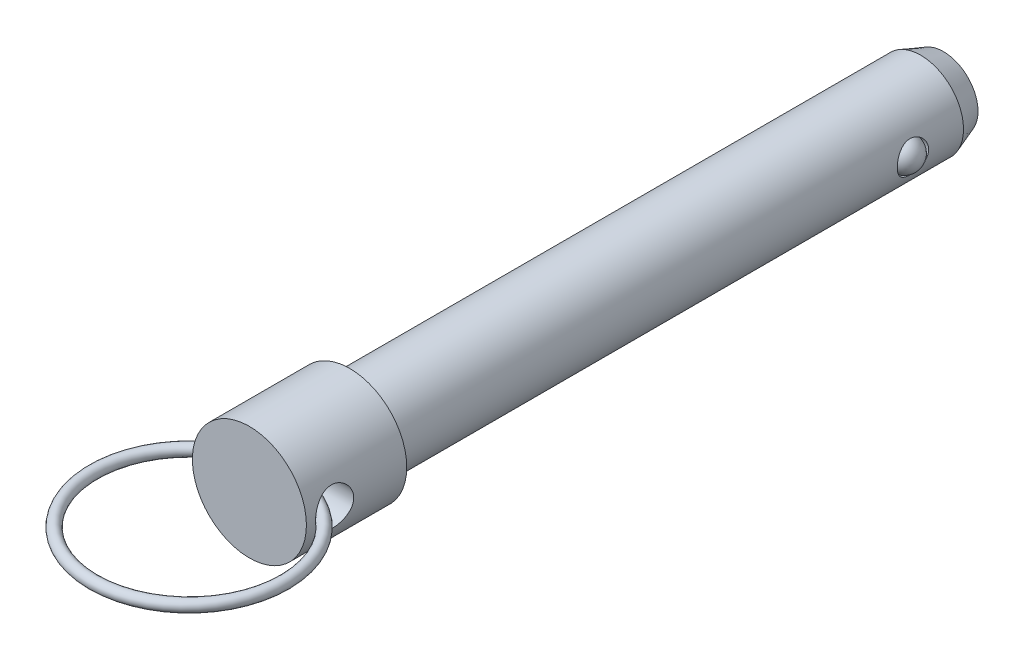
ISO-10303-21;
HEADER;
FILE_DESCRIPTION(('STEP AP214'),'2;1');
FILE_NAME('part.step','',(''),(''),'','','');
FILE_SCHEMA(('AUTOMOTIVE_DESIGN { 1 0 10303 214 1 1 1 1 }'));
ENDSEC;
DATA;
#1=APPLICATION_CONTEXT('core data for automotive mechanical design processes');
#2=APPLICATION_PROTOCOL_DEFINITION('international standard','automotive_design',2000,#1);
#3=PRODUCT_CONTEXT('',#1,'mechanical');
#4=PRODUCT('Part','Part','',(#3));
#5=PRODUCT_RELATED_PRODUCT_CATEGORY('part','',(#4));
#6=PRODUCT_DEFINITION_FORMATION('','',#4);
#7=PRODUCT_DEFINITION_CONTEXT('part definition',#1,'design');
#8=PRODUCT_DEFINITION('design','',#6,#7);
#9=PRODUCT_DEFINITION_SHAPE('','',#8);
#10=(LENGTH_UNIT() NAMED_UNIT(*) SI_UNIT(.MILLI.,.METRE.));
#11=(NAMED_UNIT(*) PLANE_ANGLE_UNIT() SI_UNIT($,.RADIAN.));
#12=(NAMED_UNIT(*) SI_UNIT($,.STERADIAN.) SOLID_ANGLE_UNIT());
#13=UNCERTAINTY_MEASURE_WITH_UNIT(LENGTH_MEASURE(1.E-05),#10,'distance_accuracy_value','');
#14=(GEOMETRIC_REPRESENTATION_CONTEXT(3) GLOBAL_UNCERTAINTY_ASSIGNED_CONTEXT((#13)) GLOBAL_UNIT_ASSIGNED_CONTEXT((#10,
#11,#12)) REPRESENTATION_CONTEXT('',''));
#15=CARTESIAN_POINT('',(0.,0.,0.));
#16=DIRECTION('',(0.,0.,1.));
#17=DIRECTION('',(1.,0.,0.));
#18=AXIS2_PLACEMENT_3D('',#15,#16,#17);
#19=CARTESIAN_POINT('',(12.7,0.,10.033));
#20=DIRECTION('',(-1.,0.,0.));
#21=DIRECTION('',(0.,0.,-1.));
#22=AXIS2_PLACEMENT_3D('',#19,#20,#21);
#23=CYLINDRICAL_SURFACE('',#22,2.6543);
#24=CARTESIAN_POINT('',(-7.93770000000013,0.204387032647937,12.6794191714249));
#25=CARTESIAN_POINT('',(-7.93203532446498,0.186837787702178,12.6807754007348));
#26=CARTESIAN_POINT('',(-7.92708864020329,0.169052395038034,12.681972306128));
#27=CARTESIAN_POINT('',(-7.91867633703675,0.133112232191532,12.6840211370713));
#28=CARTESIAN_POINT('',(-7.91521098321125,0.114957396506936,12.6848730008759));
#29=CARTESIAN_POINT('',(-7.90725600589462,0.0611097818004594,12.6868341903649));
#30=CARTESIAN_POINT('',(-7.90489267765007,0.02505510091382,12.6874261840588));
#31=CARTESIAN_POINT('',(-7.90602604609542,-0.0433721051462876,12.6871434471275));
#32=CARTESIAN_POINT('',(-7.90896866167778,-0.0757576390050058,12.6864073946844));
#33=CARTESIAN_POINT('',(-7.91964228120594,-0.140504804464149,12.6837858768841));
#34=CARTESIAN_POINT('',(-7.92748929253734,-0.172846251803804,12.6818725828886));
#35=CARTESIAN_POINT('',(-7.9377,-0.204387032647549,12.6794191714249));
#36=B_SPLINE_CURVE_WITH_KNOTS('',3,(#24,#25,#26,#27,#28,#29,#30,#31,#32,#33,#34,#35),
.UNSPECIFIED.,.F.,.F.,(4,2,2,2,2,4),(0.,0.0554397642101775,0.110889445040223,0.218734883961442,
0.315961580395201,0.41557992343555),.UNSPECIFIED.);
#37=CARTESIAN_POINT('',(-7.93507776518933,0.196079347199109,12.6800476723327));
#38=VERTEX_POINT('',#37);
#39=CARTESIAN_POINT('',(-7.93507776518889,-0.196079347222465,12.6800476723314));
#40=VERTEX_POINT('',#39);
#41=EDGE_CURVE('E40',#38,#40,#36,.T.);
#42=ORIENTED_EDGE('',*,*,#41,.F.);
#43=CARTESIAN_POINT('',(-7.9375,0.,12.6873));
#44=CARTESIAN_POINT('',(-7.93749419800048,-0.144599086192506,12.687291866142));
#45=CARTESIAN_POINT('',(-7.93350586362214,-0.289346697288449,12.6754287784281));
#46=CARTESIAN_POINT('',(-7.91796098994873,-0.574727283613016,12.628377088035));
#47=CARTESIAN_POINT('',(-7.90639187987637,-0.715353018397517,12.5931497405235));
#48=CARTESIAN_POINT('',(-7.87694898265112,-0.988107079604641,12.5007183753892));
#49=CARTESIAN_POINT('',(-7.85908971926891,-1.12025415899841,12.4435649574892));
#50=CARTESIAN_POINT('',(-7.81889219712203,-1.37303844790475,12.309089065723));
#51=CARTESIAN_POINT('',(-7.79655447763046,-1.49367704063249,12.2317690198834));
#52=CARTESIAN_POINT('',(-7.74887267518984,-1.72429338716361,12.0563063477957));
#53=CARTESIAN_POINT('',(-7.72345600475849,-1.83381503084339,11.9575840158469));
#54=CARTESIAN_POINT('',(-7.67287853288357,-2.03510055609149,11.7433473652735));
#55=CARTESIAN_POINT('',(-7.64771780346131,-2.12685956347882,11.6278284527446));
#56=CARTESIAN_POINT('',(-7.59970655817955,-2.29260675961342,11.3791865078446));
#57=CARTESIAN_POINT('',(-7.57694399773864,-2.36600365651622,11.2456506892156));
#58=CARTESIAN_POINT('',(-7.53740552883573,-2.48910328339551,10.9672472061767));
#59=CARTESIAN_POINT('',(-7.52062775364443,-2.53881340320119,10.8223830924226));
#60=CARTESIAN_POINT('',(-7.49571982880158,-2.61142261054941,10.5306017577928));
#61=CARTESIAN_POINT('',(-7.48731586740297,-2.63517327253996,10.3839205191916));
#62=CARTESIAN_POINT('',(-7.47929744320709,-2.65785147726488,10.0884327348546));
#63=CARTESIAN_POINT('',(-7.47968024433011,-2.65678674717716,9.93962686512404));
#64=CARTESIAN_POINT('',(-7.48895220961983,-2.63052542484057,9.6513899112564));
#65=CARTESIAN_POINT('',(-7.49744899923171,-2.60644192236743,9.51184259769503));
#66=CARTESIAN_POINT('',(-7.52134933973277,-2.53664290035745,9.2388960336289));
#67=CARTESIAN_POINT('',(-7.53675375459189,-2.49092467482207,9.1054975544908));
#68=CARTESIAN_POINT('',(-7.57301259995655,-2.37842702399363,8.84611048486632));
#69=CARTESIAN_POINT('',(-7.59395129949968,-2.31131832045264,8.72027699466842));
#70=CARTESIAN_POINT('',(-7.63888287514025,-2.15817695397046,8.4813127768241));
#71=CARTESIAN_POINT('',(-7.66287647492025,-2.07213980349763,8.36818507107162));
#72=CARTESIAN_POINT('',(-7.71275361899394,-1.87825870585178,8.15160000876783));
#73=CARTESIAN_POINT('',(-7.73867030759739,-1.76950815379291,8.04896027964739));
#74=CARTESIAN_POINT('',(-7.78838348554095,-1.53597600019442,7.86312488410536));
#75=CARTESIAN_POINT('',(-7.8121790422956,-1.41118740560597,7.77993774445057));
#76=CARTESIAN_POINT('',(-7.8552889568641,-1.14734212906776,7.63470081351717));
#77=CARTESIAN_POINT('',(-7.87455248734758,-1.0081467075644,7.57288742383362));
#78=CARTESIAN_POINT('',(-7.90602951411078,-0.720684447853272,7.47391173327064));
#79=CARTESIAN_POINT('',(-7.91825742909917,-0.572436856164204,7.43669899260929));
#80=CARTESIAN_POINT('',(-7.92998601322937,-0.352346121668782,7.40123858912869));
#81=CARTESIAN_POINT('',(-7.93279525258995,-0.282184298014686,7.39279721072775));
#82=CARTESIAN_POINT('',(-7.93655366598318,-0.141360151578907,7.38152592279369));
#83=CARTESIAN_POINT('',(-7.93750283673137,-0.0706978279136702,7.37869602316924));
#84=CARTESIAN_POINT('',(-7.93749419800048,0.144599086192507,7.37870813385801));
#85=CARTESIAN_POINT('',(-7.93350586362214,0.289346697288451,7.39057122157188));
#86=CARTESIAN_POINT('',(-7.91796098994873,0.574727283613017,7.43762291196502));
#87=CARTESIAN_POINT('',(-7.90639187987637,0.715353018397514,7.47285025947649));
#88=CARTESIAN_POINT('',(-7.87694898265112,0.988107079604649,7.56528162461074));
#89=CARTESIAN_POINT('',(-7.85908971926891,1.12025415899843,7.62243504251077));
#90=CARTESIAN_POINT('',(-7.81889219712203,1.37303844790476,7.75691093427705));
#91=CARTESIAN_POINT('',(-7.79655447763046,1.49367704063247,7.83423098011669));
#92=CARTESIAN_POINT('',(-7.74887267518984,1.72429338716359,8.00969365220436));
#93=CARTESIAN_POINT('',(-7.72345600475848,1.83381503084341,8.10841598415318));
#94=CARTESIAN_POINT('',(-7.67287853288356,2.03510055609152,8.32265263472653));
#95=CARTESIAN_POINT('',(-7.64771780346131,2.12685956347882,8.43817154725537));
#96=CARTESIAN_POINT('',(-7.59970655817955,2.29260675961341,8.68681349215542));
#97=CARTESIAN_POINT('',(-7.57694399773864,2.36600365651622,8.82034931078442));
#98=CARTESIAN_POINT('',(-7.53740552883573,2.4891032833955,9.09875279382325));
#99=CARTESIAN_POINT('',(-7.52062775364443,2.53881340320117,9.24361690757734));
#100=CARTESIAN_POINT('',(-7.49571982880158,2.61142261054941,9.53539824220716));
#101=CARTESIAN_POINT('',(-7.48731586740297,2.63517327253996,9.68207948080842));
#102=CARTESIAN_POINT('',(-7.4792974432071,2.65785147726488,9.97756726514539));
#103=CARTESIAN_POINT('',(-7.47968024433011,2.65678674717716,10.126373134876));
#104=CARTESIAN_POINT('',(-7.48895220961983,2.63052542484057,10.4146100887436));
#105=CARTESIAN_POINT('',(-7.49744899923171,2.60644192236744,10.554157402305));
#106=CARTESIAN_POINT('',(-7.52134933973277,2.53664290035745,10.8271039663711));
#107=CARTESIAN_POINT('',(-7.53675375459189,2.49092467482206,10.9605024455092));
#108=CARTESIAN_POINT('',(-7.57301259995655,2.37842702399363,11.2198895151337));
#109=CARTESIAN_POINT('',(-7.59395129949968,2.31131832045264,11.3457230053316));
#110=CARTESIAN_POINT('',(-7.63888287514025,2.15817695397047,11.5846872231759));
#111=CARTESIAN_POINT('',(-7.66287647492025,2.07213980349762,11.6978149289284));
#112=CARTESIAN_POINT('',(-7.71275361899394,1.87825870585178,11.9143999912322));
#113=CARTESIAN_POINT('',(-7.73867030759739,1.76950815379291,12.0170397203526));
#114=CARTESIAN_POINT('',(-7.78838348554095,1.53597600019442,12.2028751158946));
#115=CARTESIAN_POINT('',(-7.8121790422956,1.41118740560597,12.2860622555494));
#116=CARTESIAN_POINT('',(-7.8552889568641,1.14734212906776,12.4312991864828));
#117=CARTESIAN_POINT('',(-7.87455248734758,1.0081467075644,12.4931125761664));
#118=CARTESIAN_POINT('',(-7.90602951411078,0.720684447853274,12.5920882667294));
#119=CARTESIAN_POINT('',(-7.91825742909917,0.572436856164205,12.6293010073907));
#120=CARTESIAN_POINT('',(-7.92998601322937,0.352346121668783,12.6647614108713));
#121=CARTESIAN_POINT('',(-7.93279525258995,0.282184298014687,12.6732027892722));
#122=CARTESIAN_POINT('',(-7.93655366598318,0.141360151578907,12.6844740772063));
#123=CARTESIAN_POINT('',(-7.93750283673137,0.0706978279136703,12.6873039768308));
#124=CARTESIAN_POINT('',(-7.9375,0.,12.6873));
#125=B_SPLINE_CURVE_WITH_KNOTS('',3,(#43,#44,#45,#46,#47,#48,#49,#50,#51,#52,#53,#54,#55,#56,
#57,#58,#59,#60,#61,#62,#63,#64,#65,#66,#67,#68,#69,#70,#71,#72,#73,#74,#75,#76,#77,#78,#79,#80,
#81,#82,#83,#84,#85,#86,#87,#88,#89,#90,#91,#92,#93,#94,#95,#96,#97,#98,#99,#100,#101,#102,#103,
#104,#105,#106,#107,#108,#109,#110,#111,#112,#113,#114,#115,#116,#117,#118,#119,#120,#121,#122,
#123,#124),.UNSPECIFIED.,.T.,.F.,(4,2,2,2,2,2,2,2,2,2,2,2,2,2,2,2,2,2,2,2,2,2,2,2,2,2,2,2,2,2,2,
2,2,2,2,2,2,2,2,2,4),(0.,0.433524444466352,0.867769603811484,1.30101860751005,1.7342154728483,
2.18107203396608,2.62805104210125,3.08796860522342,3.54774258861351,3.99193400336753,
4.43598710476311,4.85959963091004,5.28326515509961,5.71379590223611,6.14442882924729,
6.59763251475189,7.05103448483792,7.50930185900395,7.9666266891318,8.17858641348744,
8.390546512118,8.82407095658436,9.25831611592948,9.69156511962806,10.1247619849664,
10.5716185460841,11.0185975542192,11.4785151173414,11.9382891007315,12.3824805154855,
12.8265336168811,13.250146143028,13.6738116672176,14.1043424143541,14.5349753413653,
14.9881790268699,15.4415809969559,15.8998483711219,16.3571732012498,16.5691329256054,
16.781093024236),.UNSPECIFIED.);
#126=EDGE_CURVE('E66',#40,#38,#125,.T.);
#127=ORIENTED_EDGE('',*,*,#126,.F.);
#128=EDGE_LOOP('',(#42,#127));
#129=FACE_BOUND('',#128,.T.);
#130=CARTESIAN_POINT('',(7.9377,-0.20438703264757,12.6794191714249));
#131=CARTESIAN_POINT('',(7.93203532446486,-0.186837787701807,12.6807754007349));
#132=CARTESIAN_POINT('',(7.92708864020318,-0.169052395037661,12.681972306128));
#133=CARTESIAN_POINT('',(7.91867633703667,-0.133112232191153,12.6840211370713));
#134=CARTESIAN_POINT('',(7.91521098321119,-0.114957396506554,12.6848730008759));
#135=CARTESIAN_POINT('',(7.90725600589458,-0.0611097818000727,12.6868341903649));
#136=CARTESIAN_POINT('',(7.90489267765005,-0.0250551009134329,12.6874261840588));
#137=CARTESIAN_POINT('',(7.90602604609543,0.0433721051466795,12.6871434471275));
#138=CARTESIAN_POINT('',(7.90896866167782,0.0757576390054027,12.6864073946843));
#139=CARTESIAN_POINT('',(7.91964228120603,0.140504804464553,12.683785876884));
#140=CARTESIAN_POINT('',(7.92748929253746,0.172846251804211,12.6818725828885));
#141=CARTESIAN_POINT('',(7.93770000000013,0.204387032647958,12.6794191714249));
#142=B_SPLINE_CURVE_WITH_KNOTS('',3,(#130,#131,#132,#133,#134,#135,#136,#137,#138,#139,#140,
#141),.UNSPECIFIED.,.F.,.F.,(4,2,2,2,2,4),(0.,0.0554397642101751,0.110889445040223,
0.21873488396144,0.31596158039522,0.415579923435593),.UNSPECIFIED.);
#143=CARTESIAN_POINT('',(7.93507776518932,-0.196079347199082,12.6800476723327));
#144=VERTEX_POINT('',#143);
#145=CARTESIAN_POINT('',(7.93507776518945,0.196079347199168,12.6800476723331));
#146=VERTEX_POINT('',#145);
#147=EDGE_CURVE('E33',#144,#146,#142,.T.);
#148=ORIENTED_EDGE('',*,*,#147,.F.);
#149=CARTESIAN_POINT('',(7.9375,0.,7.3787));
#150=CARTESIAN_POINT('',(7.93749419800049,-0.144599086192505,7.37870813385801));
#151=CARTESIAN_POINT('',(7.93350586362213,-0.289346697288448,7.39057122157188));
#152=CARTESIAN_POINT('',(7.91796098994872,-0.574727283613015,7.43762291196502));
#153=CARTESIAN_POINT('',(7.90639187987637,-0.715353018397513,7.47285025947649));
#154=CARTESIAN_POINT('',(7.87694898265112,-0.988107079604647,7.56528162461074));
#155=CARTESIAN_POINT('',(7.8590897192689,-1.12025415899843,7.62243504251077));
#156=CARTESIAN_POINT('',(7.81889219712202,-1.37303844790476,7.75691093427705));
#157=CARTESIAN_POINT('',(7.79655447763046,-1.49367704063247,7.83423098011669));
#158=CARTESIAN_POINT('',(7.74887267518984,-1.72429338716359,8.00969365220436));
#159=CARTESIAN_POINT('',(7.72345600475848,-1.8338150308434,8.10841598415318));
#160=CARTESIAN_POINT('',(7.67287853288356,-2.03510055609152,8.32265263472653));
#161=CARTESIAN_POINT('',(7.64771780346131,-2.12685956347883,8.43817154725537));
#162=CARTESIAN_POINT('',(7.59970655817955,-2.29260675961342,8.68681349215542));
#163=CARTESIAN_POINT('',(7.57694399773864,-2.36600365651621,8.82034931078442));
#164=CARTESIAN_POINT('',(7.53740552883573,-2.4891032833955,9.09875279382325));
#165=CARTESIAN_POINT('',(7.52062775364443,-2.53881340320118,9.24361690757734));
#166=CARTESIAN_POINT('',(7.49571982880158,-2.61142261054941,9.53539824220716));
#167=CARTESIAN_POINT('',(7.48731586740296,-2.63517327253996,9.68207948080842));
#168=CARTESIAN_POINT('',(7.47929744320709,-2.65785147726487,9.97756726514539));
#169=CARTESIAN_POINT('',(7.47968024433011,-2.65678674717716,10.126373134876));
#170=CARTESIAN_POINT('',(7.48895220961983,-2.63052542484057,10.4146100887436));
#171=CARTESIAN_POINT('',(7.49744899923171,-2.60644192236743,10.554157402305));
#172=CARTESIAN_POINT('',(7.52134933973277,-2.53664290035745,10.8271039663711));
#173=CARTESIAN_POINT('',(7.53675375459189,-2.49092467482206,10.9605024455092));
#174=CARTESIAN_POINT('',(7.57301259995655,-2.37842702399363,11.2198895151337));
#175=CARTESIAN_POINT('',(7.59395129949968,-2.31131832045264,11.3457230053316));
#176=CARTESIAN_POINT('',(7.63888287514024,-2.15817695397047,11.5846872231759));
#177=CARTESIAN_POINT('',(7.66287647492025,-2.07213980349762,11.6978149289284));
#178=CARTESIAN_POINT('',(7.71275361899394,-1.87825870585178,11.9143999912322));
#179=CARTESIAN_POINT('',(7.73867030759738,-1.76950815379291,12.0170397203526));
#180=CARTESIAN_POINT('',(7.78838348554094,-1.53597600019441,12.2028751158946));
#181=CARTESIAN_POINT('',(7.8121790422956,-1.41118740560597,12.2860622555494));
#182=CARTESIAN_POINT('',(7.8552889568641,-1.14734212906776,12.4312991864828));
#183=CARTESIAN_POINT('',(7.87455248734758,-1.0081467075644,12.4931125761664));
#184=CARTESIAN_POINT('',(7.90602951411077,-0.72068444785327,12.5920882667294));
#185=CARTESIAN_POINT('',(7.91825742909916,-0.5724368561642,12.6293010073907));
#186=CARTESIAN_POINT('',(7.92998601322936,-0.352346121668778,12.6647614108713));
#187=CARTESIAN_POINT('',(7.93279525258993,-0.282184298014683,12.6732027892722));
#188=CARTESIAN_POINT('',(7.93655366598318,-0.141360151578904,12.6844740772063));
#189=CARTESIAN_POINT('',(7.93750283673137,-0.0706978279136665,12.6873039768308));
#190=CARTESIAN_POINT('',(7.93749419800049,0.14459908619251,12.687291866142));
#191=CARTESIAN_POINT('',(7.93350586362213,0.289346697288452,12.6754287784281));
#192=CARTESIAN_POINT('',(7.91796098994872,0.574727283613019,12.628377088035));
#193=CARTESIAN_POINT('',(7.90639187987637,0.71535301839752,12.5931497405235));
#194=CARTESIAN_POINT('',(7.87694898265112,0.988107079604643,12.5007183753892));
#195=CARTESIAN_POINT('',(7.8590897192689,1.12025415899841,12.4435649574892));
#196=CARTESIAN_POINT('',(7.81889219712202,1.37303844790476,12.309089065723));
#197=CARTESIAN_POINT('',(7.79655447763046,1.49367704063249,12.2317690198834));
#198=CARTESIAN_POINT('',(7.74887267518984,1.72429338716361,12.0563063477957));
#199=CARTESIAN_POINT('',(7.72345600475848,1.83381503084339,11.9575840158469));
#200=CARTESIAN_POINT('',(7.67287853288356,2.03510055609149,11.7433473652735));
#201=CARTESIAN_POINT('',(7.64771780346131,2.12685956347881,11.6278284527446));
#202=CARTESIAN_POINT('',(7.59970655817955,2.29260675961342,11.3791865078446));
#203=CARTESIAN_POINT('',(7.57694399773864,2.36600365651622,11.2456506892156));
#204=CARTESIAN_POINT('',(7.53740552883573,2.48910328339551,10.9672472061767));
#205=CARTESIAN_POINT('',(7.52062775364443,2.53881340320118,10.8223830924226));
#206=CARTESIAN_POINT('',(7.49571982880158,2.61142261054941,10.5306017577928));
#207=CARTESIAN_POINT('',(7.48731586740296,2.63517327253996,10.3839205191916));
#208=CARTESIAN_POINT('',(7.47929744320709,2.65785147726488,10.0884327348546));
#209=CARTESIAN_POINT('',(7.47968024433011,2.65678674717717,9.93962686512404));
#210=CARTESIAN_POINT('',(7.48895220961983,2.63052542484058,9.6513899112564));
#211=CARTESIAN_POINT('',(7.49744899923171,2.60644192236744,9.51184259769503));
#212=CARTESIAN_POINT('',(7.52134933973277,2.53664290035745,9.23889603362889));
#213=CARTESIAN_POINT('',(7.53675375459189,2.49092467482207,9.1054975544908));
#214=CARTESIAN_POINT('',(7.57301259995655,2.37842702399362,8.84611048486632));
#215=CARTESIAN_POINT('',(7.59395129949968,2.31131832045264,8.72027699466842));
#216=CARTESIAN_POINT('',(7.63888287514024,2.15817695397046,8.4813127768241));
#217=CARTESIAN_POINT('',(7.66287647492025,2.07213980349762,8.36818507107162));
#218=CARTESIAN_POINT('',(7.71275361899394,1.87825870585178,8.15160000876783));
#219=CARTESIAN_POINT('',(7.73867030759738,1.76950815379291,8.04896027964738));
#220=CARTESIAN_POINT('',(7.78838348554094,1.53597600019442,7.86312488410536));
#221=CARTESIAN_POINT('',(7.8121790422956,1.41118740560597,7.77993774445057));
#222=CARTESIAN_POINT('',(7.8552889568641,1.14734212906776,7.63470081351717));
#223=CARTESIAN_POINT('',(7.87455248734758,1.0081467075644,7.57288742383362));
#224=CARTESIAN_POINT('',(7.90602951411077,0.720684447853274,7.47391173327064));
#225=CARTESIAN_POINT('',(7.91825742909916,0.572436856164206,7.43669899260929));
#226=CARTESIAN_POINT('',(7.92998601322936,0.352346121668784,7.40123858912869));
#227=CARTESIAN_POINT('',(7.93279525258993,0.282184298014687,7.39279721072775));
#228=CARTESIAN_POINT('',(7.93655366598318,0.141360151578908,7.38152592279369));
#229=CARTESIAN_POINT('',(7.93750283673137,0.0706978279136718,7.37869602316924));
#230=CARTESIAN_POINT('',(7.9375,0.,7.3787));
#231=B_SPLINE_CURVE_WITH_KNOTS('',3,(#149,#150,#151,#152,#153,#154,#155,#156,#157,#158,#159,
#160,#161,#162,#163,#164,#165,#166,#167,#168,#169,#170,#171,#172,#173,#174,#175,#176,#177,#178,
#179,#180,#181,#182,#183,#184,#185,#186,#187,#188,#189,#190,#191,#192,#193,#194,#195,#196,#197,
#198,#199,#200,#201,#202,#203,#204,#205,#206,#207,#208,#209,#210,#211,#212,#213,#214,#215,#216,
#217,#218,#219,#220,#221,#222,#223,#224,#225,#226,#227,#228,#229,#230),.UNSPECIFIED.,.T.,.F.,(4,
2,2,2,2,2,2,2,2,2,2,2,2,2,2,2,2,2,2,2,2,2,2,2,2,2,2,2,2,2,2,2,2,2,2,2,2,2,2,2,4),(0.,
0.433524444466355,0.867769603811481,1.30101860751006,1.73421547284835,2.18107203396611,
2.62805104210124,3.0879686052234,3.54774258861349,3.99193400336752,4.4359871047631,
4.85959963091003,5.28326515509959,5.71379590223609,6.14442882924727,6.59763251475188,
7.0510344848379,7.50930185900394,7.96662668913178,8.17858641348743,8.39054651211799,
8.82407095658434,9.25831611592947,9.69156511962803,10.1247619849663,10.5716185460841,
11.0185975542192,11.4785151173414,11.9382891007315,12.3824805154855,12.8265336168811,
13.250146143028,13.6738116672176,14.1043424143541,14.5349753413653,14.9881790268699,
15.4415809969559,15.8998483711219,16.3571732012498,16.5691329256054,16.781093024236),.UNSPECIFIED.);
#232=EDGE_CURVE('E62',#146,#144,#231,.T.);
#233=ORIENTED_EDGE('',*,*,#232,.F.);
#234=EDGE_LOOP('',(#148,#233));
#235=FACE_BOUND('',#234,.T.);
#236=ADVANCED_FACE('F14',(#129,#235),#23,.F.);
#237=CARTESIAN_POINT('',(0.,0.,-42.672));
#238=DIRECTION('',(0.,0.,-1.));
#239=DIRECTION('',(1.,0.,0.));
#240=AXIS2_PLACEMENT_3D('',#237,#238,#239);
#241=CYLINDRICAL_SURFACE('',#240,7.9375);
#242=ORIENTED_EDGE('',*,*,#232,.T.);
#243=CARTESIAN_POINT('',(7.93699330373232,-0.0896892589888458,10.7221702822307));
#244=CARTESIAN_POINT('',(7.93652822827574,-0.130769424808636,10.7274679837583));
#245=CARTESIAN_POINT('',(7.93574664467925,-0.171433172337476,10.7364092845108));
#246=CARTESIAN_POINT('',(7.93364106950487,-0.250655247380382,10.7611923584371));
#247=CARTESIAN_POINT('',(7.93231567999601,-0.289207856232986,10.7770519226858));
#248=CARTESIAN_POINT('',(7.92928275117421,-0.36295793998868,10.8148927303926));
#249=CARTESIAN_POINT('',(7.92757676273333,-0.398168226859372,10.8368492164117));
#250=CARTESIAN_POINT('',(7.92395955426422,-0.46463035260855,10.8860295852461));
#251=CARTESIAN_POINT('',(7.92204841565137,-0.495883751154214,10.9132513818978));
#252=CARTESIAN_POINT('',(7.91808508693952,-0.555685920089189,10.97377260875));
#253=CARTESIAN_POINT('',(7.91603122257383,-0.583966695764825,11.0073356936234));
#254=CARTESIAN_POINT('',(7.91207775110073,-0.635291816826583,11.0782504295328));
#255=CARTESIAN_POINT('',(7.91017822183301,-0.658333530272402,11.1156039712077));
#256=CARTESIAN_POINT('',(7.90643802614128,-0.701917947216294,11.1984415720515));
#257=CARTESIAN_POINT('',(7.90464142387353,-0.721680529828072,11.2443371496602));
#258=CARTESIAN_POINT('',(7.90157869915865,-0.754473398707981,11.3384773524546));
#259=CARTESIAN_POINT('',(7.90031286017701,-0.767500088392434,11.3867232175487));
#260=CARTESIAN_POINT('',(7.89822583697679,-0.78871450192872,11.492699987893));
#261=CARTESIAN_POINT('',(7.89751439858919,-0.795728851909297,11.5506679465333));
#262=CARTESIAN_POINT('',(7.89694142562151,-0.801390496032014,11.6670214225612));
#263=CARTESIAN_POINT('',(7.89708055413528,-0.800031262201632,11.7254072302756));
#264=CARTESIAN_POINT('',(7.89824238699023,-0.788490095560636,11.8504865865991));
#265=CARTESIAN_POINT('',(7.89939936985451,-0.776966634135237,11.9170573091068));
#266=CARTESIAN_POINT('',(7.90261098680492,-0.743590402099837,12.0475728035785));
#267=CARTESIAN_POINT('',(7.90466591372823,-0.72173426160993,12.1115167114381));
#268=CARTESIAN_POINT('',(7.90910435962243,-0.671214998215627,12.2269281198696));
#269=CARTESIAN_POINT('',(7.91141136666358,-0.643792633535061,12.2789413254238));
#270=CARTESIAN_POINT('',(7.9162723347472,-0.580974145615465,12.3779063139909));
#271=CARTESIAN_POINT('',(7.91882592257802,-0.545589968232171,12.4248655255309));
#272=CARTESIAN_POINT('',(7.92321294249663,-0.476924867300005,12.5002173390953));
#273=CARTESIAN_POINT('',(7.92506174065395,-0.445468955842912,12.5302699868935));
#274=CARTESIAN_POINT('',(7.92855714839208,-0.378177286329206,12.5850250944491));
#275=CARTESIAN_POINT('',(7.93020403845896,-0.342347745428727,12.6097350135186));
#276=CARTESIAN_POINT('',(7.93284282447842,-0.273620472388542,12.648375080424));
#277=CARTESIAN_POINT('',(7.93389934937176,-0.241370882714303,12.6634477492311));
#278=CARTESIAN_POINT('',(7.93564462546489,-0.174801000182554,12.6880445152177));
#279=CARTESIAN_POINT('',(7.93633364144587,-0.140482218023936,12.6975726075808));
#280=CARTESIAN_POINT('',(7.93726439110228,-0.0704929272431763,12.7103916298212));
#281=CARTESIAN_POINT('',(7.93750383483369,-0.0348164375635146,12.7136506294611));
#282=CARTESIAN_POINT('',(7.93749607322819,0.0365249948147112,12.7135447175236));
#283=CARTESIAN_POINT('',(7.93724892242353,0.0721899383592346,12.7101805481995));
#284=CARTESIAN_POINT('',(7.93634013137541,0.139477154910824,12.6976601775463));
#285=CARTESIAN_POINT('',(7.93571355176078,0.171193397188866,12.6889933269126));
#286=CARTESIAN_POINT('',(7.93414262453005,0.232898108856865,12.6668946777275));
#287=CARTESIAN_POINT('',(7.93319815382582,0.262885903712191,12.6534610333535));
#288=CARTESIAN_POINT('',(7.93070953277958,0.330541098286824,12.6172427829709));
#289=CARTESIAN_POINT('',(7.92907073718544,0.367334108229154,12.5928314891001));
#290=CARTESIAN_POINT('',(7.92556681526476,0.436465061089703,12.5383604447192));
#291=CARTESIAN_POINT('',(7.92370123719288,0.468793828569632,12.5082893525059));
#292=CARTESIAN_POINT('',(7.91930040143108,0.538689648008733,12.4333509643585));
#293=CARTESIAN_POINT('',(7.916745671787,0.57451190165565,12.3868610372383));
#294=CARTESIAN_POINT('',(7.91186591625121,0.638204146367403,12.2887606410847));
#295=CARTESIAN_POINT('',(7.90954108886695,0.666067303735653,12.2371458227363));
#296=CARTESIAN_POINT('',(7.90531287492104,0.714519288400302,12.1292928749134));
#297=CARTESIAN_POINT('',(7.9034194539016,0.734941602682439,12.0729799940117));
#298=CARTESIAN_POINT('',(7.90030657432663,0.767678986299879,11.9580314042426));
#299=CARTESIAN_POINT('',(7.89908731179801,0.779991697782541,11.899395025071));
#300=CARTESIAN_POINT('',(7.89731302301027,0.797780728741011,11.7702903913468));
#301=CARTESIAN_POINT('',(7.89691665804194,0.801631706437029,11.6995888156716));
#302=CARTESIAN_POINT('',(7.89737434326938,0.797116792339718,11.5585490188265));
#303=CARTESIAN_POINT('',(7.89822786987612,0.788756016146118,11.488210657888));
#304=CARTESIAN_POINT('',(7.90084404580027,0.762038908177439,11.3643204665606));
#305=CARTESIAN_POINT('',(7.90238770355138,0.746048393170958,11.3102526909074));
#306=CARTESIAN_POINT('',(7.90611632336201,0.705442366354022,11.205488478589));
#307=CARTESIAN_POINT('',(7.90830043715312,0.680838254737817,11.1547876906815));
#308=CARTESIAN_POINT('',(7.91271138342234,0.627302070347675,11.0659203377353));
#309=CARTESIAN_POINT('',(7.91488171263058,0.599588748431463,11.0270181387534));
#310=CARTESIAN_POINT('',(7.91930072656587,0.538080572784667,10.9543274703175));
#311=CARTESIAN_POINT('',(7.92154938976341,0.50428737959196,10.9205376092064));
#312=CARTESIAN_POINT('',(7.9258769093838,0.430969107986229,10.8593220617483));
#313=CARTESIAN_POINT('',(7.92795469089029,0.39141152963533,10.8319349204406));
#314=CARTESIAN_POINT('',(7.93164182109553,0.3077475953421,10.7851847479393));
#315=CARTESIAN_POINT('',(7.93325121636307,0.263641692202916,10.7658209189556));
#316=CARTESIAN_POINT('',(7.93561569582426,0.177621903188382,10.7379200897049));
#317=CARTESIAN_POINT('',(7.93644685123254,0.136024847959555,10.7284058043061));
#318=CARTESIAN_POINT('',(7.93744121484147,0.0518653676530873,10.7170577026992));
#319=CARTESIAN_POINT('',(7.93760632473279,0.0093060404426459,10.7152020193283));
#320=CARTESIAN_POINT('',(7.93735299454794,-0.0519629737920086,10.7180810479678));
#321=CARTESIAN_POINT('',(7.93720636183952,-0.070869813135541,10.7197433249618));
#322=CARTESIAN_POINT('',(7.93699330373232,-0.0896892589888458,10.7221702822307));
#323=B_SPLINE_CURVE_WITH_KNOTS('',3,(#243,#244,#245,#246,#247,#248,#249,#250,#251,#252,#253,
#254,#255,#256,#257,#258,#259,#260,#261,#262,#263,#264,#265,#266,#267,#268,#269,#270,#271,#272,
#273,#274,#275,#276,#277,#278,#279,#280,#281,#282,#283,#284,#285,#286,#287,#288,#289,#290,#291,
#292,#293,#294,#295,#296,#297,#298,#299,#300,#301,#302,#303,#304,#305,#306,#307,#308,#309,#310,
#311,#312,#313,#314,#315,#316,#317,#318,#319,#320,#321,#322),.UNSPECIFIED.,.T.,.F.,(4,2,2,2,2,2,
2,2,2,2,2,2,2,2,2,2,2,2,2,2,2,2,2,2,2,2,2,2,2,2,2,2,2,2,2,2,2,2,2,4),(0.,0.124210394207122,
0.248742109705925,0.372775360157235,0.496759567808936,0.628051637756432,0.759409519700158,
0.908842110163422,1.05835440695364,1.23286722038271,1.40751609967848,1.60937414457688,
1.81129806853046,1.98719085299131,2.16282146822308,2.29300546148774,2.42300650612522,
2.52941287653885,2.63574247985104,2.7426122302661,2.84947000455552,2.94770394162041,
3.04597595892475,3.17780580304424,3.30990269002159,3.48520218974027,3.66065175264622,
3.83981616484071,4.01903264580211,4.23044221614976,4.44176325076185,4.61030957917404,
4.7786336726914,4.92148031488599,5.06428800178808,5.20793445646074,5.35156662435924,
5.47894362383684,5.60595667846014,5.66285934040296),.UNSPECIFIED.);
#324=EDGE_CURVE('E27',#144,#146,#323,.T.);
#325=ORIENTED_EDGE('',*,*,#324,.T.);
#326=EDGE_LOOP('',(#242,#325));
#327=FACE_BOUND('',#326,.T.);
#328=CARTESIAN_POINT('',(0.,0.,13.97));
#329=DIRECTION('',(0.,0.,-1.));
#330=DIRECTION('',(1.,0.,0.));
#331=AXIS2_PLACEMENT_3D('',#328,#329,#330);
#332=CIRCLE('',#331,7.9375);
#333=CARTESIAN_POINT('',(7.93749999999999,0.,13.97));
#334=VERTEX_POINT('',#333);
#335=EDGE_CURVE('E70',#334,#334,#332,.T.);
#336=ORIENTED_EDGE('',*,*,#335,.T.);
#337=EDGE_LOOP('',(#336));
#338=FACE_BOUND('',#337,.T.);
#339=CARTESIAN_POINT('',(0.,0.,0.));
#340=DIRECTION('',(0.,0.,-1.));
#341=DIRECTION('',(1.,0.,0.));
#342=AXIS2_PLACEMENT_3D('',#339,#340,#341);
#343=CIRCLE('',#342,7.9375);
#344=CARTESIAN_POINT('',(7.9375,0.,0.));
#345=VERTEX_POINT('',#344);
#346=EDGE_CURVE('E60',#345,#345,#343,.T.);
#347=ORIENTED_EDGE('',*,*,#346,.F.);
#348=EDGE_LOOP('',(#347));
#349=FACE_BOUND('',#348,.T.);
#350=ORIENTED_EDGE('',*,*,#126,.T.);
#351=CARTESIAN_POINT('',(-7.93699330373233,-0.0896892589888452,10.7221702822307));
#352=CARTESIAN_POINT('',(-7.93743878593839,-0.0502040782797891,10.7170881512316));
#353=CARTESIAN_POINT('',(-7.93759300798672,-0.0102169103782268,10.7153578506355));
#354=CARTESIAN_POINT('',(-7.93729618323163,0.0695313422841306,10.7187230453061));
#355=CARTESIAN_POINT('',(-7.93684363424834,0.109291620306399,10.7238354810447));
#356=CARTESIAN_POINT('',(-7.9353856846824,0.187291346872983,10.7406573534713));
#357=CARTESIAN_POINT('',(-7.93438148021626,0.225533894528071,10.7523525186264));
#358=CARTESIAN_POINT('',(-7.93193240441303,0.299545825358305,10.7818254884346));
#359=CARTESIAN_POINT('',(-7.93048773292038,0.335316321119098,10.7996005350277));
#360=CARTESIAN_POINT('',(-7.92726719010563,0.404436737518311,10.8410428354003));
#361=CARTESIAN_POINT('',(-7.92548405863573,0.437705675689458,10.8648440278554));
#362=CARTESIAN_POINT('',(-7.92178517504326,0.50020841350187,10.9172387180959));
#363=CARTESIAN_POINT('',(-7.91986937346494,0.529440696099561,10.9458340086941));
#364=CARTESIAN_POINT('',(-7.915887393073,0.586103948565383,11.0098741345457));
#365=CARTESIAN_POINT('',(-7.91382457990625,0.613087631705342,11.0457138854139));
#366=CARTESIAN_POINT('',(-7.90992227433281,0.661534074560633,11.1209464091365));
#367=CARTESIAN_POINT('',(-7.908082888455,0.682994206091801,11.1603408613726));
#368=CARTESIAN_POINT('',(-7.90452540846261,0.723082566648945,11.2475242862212));
#369=CARTESIAN_POINT('',(-7.90286277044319,0.740860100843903,11.2957058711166));
#370=CARTESIAN_POINT('',(-7.90013513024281,0.769398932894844,11.3941063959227));
#371=CARTESIAN_POINT('',(-7.89907043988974,0.780156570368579,11.4443263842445));
#372=CARTESIAN_POINT('',(-7.89747012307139,0.796210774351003,11.554348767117));
#373=CARTESIAN_POINT('',(-7.89705467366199,0.800273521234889,11.6143332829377));
#374=CARTESIAN_POINT('',(-7.89711253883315,0.79969743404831,11.734278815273));
#375=CARTESIAN_POINT('',(-7.89758667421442,0.795050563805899,11.7942397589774));
#376=CARTESIAN_POINT('',(-7.89947092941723,0.776127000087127,11.9215738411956));
#377=CARTESIAN_POINT('',(-7.90100736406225,0.760545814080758,11.9887539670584));
#378=CARTESIAN_POINT('',(-7.90492609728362,0.718674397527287,12.1196981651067));
#379=CARTESIAN_POINT('',(-7.90730830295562,0.692385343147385,12.1834626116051));
#380=CARTESIAN_POINT('',(-7.91207290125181,0.635336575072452,12.2932216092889));
#381=CARTESIAN_POINT('',(-7.91436076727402,0.606509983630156,12.3402260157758));
#382=CARTESIAN_POINT('',(-7.91905560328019,0.5417717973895,12.4290764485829));
#383=CARTESIAN_POINT('',(-7.92146237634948,0.505871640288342,12.4709306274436));
#384=CARTESIAN_POINT('',(-7.92553520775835,0.43667233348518,12.5379057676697));
#385=CARTESIAN_POINT('',(-7.9272377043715,0.404910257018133,12.5646091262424));
#386=CARTESIAN_POINT('',(-7.93039270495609,0.337506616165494,12.6126059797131));
#387=CARTESIAN_POINT('',(-7.93184553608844,0.301870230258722,12.6339065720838));
#388=CARTESIAN_POINT('',(-7.93412813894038,0.2334262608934,12.6667329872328));
#389=CARTESIAN_POINT('',(-7.93502109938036,0.201118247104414,12.6792905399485));
#390=CARTESIAN_POINT('',(-7.93642349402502,0.13484532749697,12.698839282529));
#391=CARTESIAN_POINT('',(-7.93693318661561,0.100881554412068,12.7058342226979));
#392=CARTESIAN_POINT('',(-7.93750968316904,0.032116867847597,12.7137372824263));
#393=CARTESIAN_POINT('',(-7.93757492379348,-0.00268656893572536,12.7146239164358));
#394=CARTESIAN_POINT('',(-7.93724990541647,-0.0718898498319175,12.7101777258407));
#395=CARTESIAN_POINT('',(-7.93685959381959,-0.106289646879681,12.7048441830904));
#396=CARTESIAN_POINT('',(-7.9357035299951,-0.171860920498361,12.6888272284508));
#397=CARTESIAN_POINT('',(-7.93495870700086,-0.203106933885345,12.6784414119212));
#398=CARTESIAN_POINT('',(-7.93317724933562,-0.263675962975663,12.6531254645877));
#399=CARTESIAN_POINT('',(-7.93214049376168,-0.292998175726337,12.6381934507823));
#400=CARTESIAN_POINT('',(-7.92940993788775,-0.360428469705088,12.597867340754));
#401=CARTESIAN_POINT('',(-7.9276181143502,-0.397454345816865,12.5706684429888));
#402=CARTESIAN_POINT('',(-7.92384885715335,-0.466617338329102,12.5106364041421));
#403=CARTESIAN_POINT('',(-7.92187102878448,-0.498743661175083,12.4777911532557));
#404=CARTESIAN_POINT('',(-7.91727343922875,-0.567662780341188,12.3965661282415));
#405=CARTESIAN_POINT('',(-7.91465361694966,-0.602587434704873,12.346603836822));
#406=CARTESIAN_POINT('',(-7.90974454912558,-0.663922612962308,12.2417401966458));
#407=CARTESIAN_POINT('',(-7.90745554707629,-0.690326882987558,12.186835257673));
#408=CARTESIAN_POINT('',(-7.90341151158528,-0.735193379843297,12.0726554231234));
#409=CARTESIAN_POINT('',(-7.90166748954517,-0.753494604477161,12.0133171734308));
#410=CARTESIAN_POINT('',(-7.89896245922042,-0.781340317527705,11.8925933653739));
#411=CARTESIAN_POINT('',(-7.89800176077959,-0.79088134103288,11.8312070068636));
#412=CARTESIAN_POINT('',(-7.89691830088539,-0.801641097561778,11.6985240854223));
#413=CARTESIAN_POINT('',(-7.89694027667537,-0.801422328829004,11.6271030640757));
#414=CARTESIAN_POINT('',(-7.89826395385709,-0.788278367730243,11.4854399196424));
#415=CARTESIAN_POINT('',(-7.89956436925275,-0.775365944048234,11.4151966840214));
#416=CARTESIAN_POINT('',(-7.90287421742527,-0.740743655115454,11.2949246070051));
#417=CARTESIAN_POINT('',(-7.90464052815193,-0.721867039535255,11.2440707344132));
#418=CARTESIAN_POINT('',(-7.90869169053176,-0.676041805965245,11.1461339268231));
#419=CARTESIAN_POINT('',(-7.91097624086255,-0.649097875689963,11.0990488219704));
#420=CARTESIAN_POINT('',(-7.91583237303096,-0.586925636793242,11.0101024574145));
#421=CARTESIAN_POINT('',(-7.91840607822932,-0.551633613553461,10.968285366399));
#422=CARTESIAN_POINT('',(-7.9234657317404,-0.473413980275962,10.8924229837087));
#423=CARTESIAN_POINT('',(-7.9259517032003,-0.430488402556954,10.858375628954));
#424=CARTESIAN_POINT('',(-7.93009831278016,-0.344976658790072,10.804366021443));
#425=CARTESIAN_POINT('',(-7.93182618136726,-0.303224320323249,10.7830841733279));
#426=CARTESIAN_POINT('',(-7.93466471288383,-0.216479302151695,10.7489652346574));
#427=CARTESIAN_POINT('',(-7.93577772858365,-0.171499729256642,10.7360959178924));
#428=CARTESIAN_POINT('',(-7.93669343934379,-0.113804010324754,10.7255939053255));
#429=CARTESIAN_POINT('',(-7.93685700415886,-0.101770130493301,10.7237252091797));
#430=CARTESIAN_POINT('',(-7.93699330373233,-0.0896892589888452,10.7221702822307));
#431=B_SPLINE_CURVE_WITH_KNOTS('',3,(#351,#352,#353,#354,#355,#356,#357,#358,#359,#360,#361,
#362,#363,#364,#365,#366,#367,#368,#369,#370,#371,#372,#373,#374,#375,#376,#377,#378,#379,#380,
#381,#382,#383,#384,#385,#386,#387,#388,#389,#390,#391,#392,#393,#394,#395,#396,#397,#398,#399,
#400,#401,#402,#403,#404,#405,#406,#407,#408,#409,#410,#411,#412,#413,#414,#415,#416,#417,#418,
#419,#420,#421,#422,#423,#424,#425,#426,#427,#428,#429,#430),.UNSPECIFIED.,.T.,.F.,(4,2,2,2,2,2,
2,2,2,2,2,2,2,2,2,2,2,2,2,2,2,2,2,2,2,2,2,2,2,2,2,2,2,2,2,2,2,2,2,4),(0.,0.119408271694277,
0.239112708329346,0.358558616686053,0.477950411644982,0.600273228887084,0.722641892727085,
0.856839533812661,0.99110091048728,1.1446646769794,1.2983084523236,1.47797963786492,
1.65781668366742,1.86385758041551,2.06987585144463,2.23486354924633,2.39958662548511,
2.52373987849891,2.64772917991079,2.75131418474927,2.85482929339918,2.95870832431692,
3.06259934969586,3.16100048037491,3.25944242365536,3.39661525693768,3.53408604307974,
3.7161618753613,3.89837104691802,4.08405383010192,4.26981002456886,4.48300506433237,
4.69598586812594,4.85816260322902,5.02024528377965,5.183607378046,5.34692604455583,
5.48682759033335,5.62619001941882,5.66272413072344),.UNSPECIFIED.);
#432=EDGE_CURVE('E9',#38,#40,#431,.T.);
#433=ORIENTED_EDGE('',*,*,#432,.T.);
#434=EDGE_LOOP('',(#350,#433));
#435=FACE_BOUND('',#434,.T.);
#436=ADVANCED_FACE('F64',(#327,#338,#349,#435),#241,.T.);
#437=CARTESIAN_POINT('',(0.,0.,0.));
#438=DIRECTION('',(0.,0.,-1.));
#439=DIRECTION('',(-1.,0.,0.));
#440=AXIS2_PLACEMENT_3D('',#437,#438,#439);
#441=PLANE('',#440);
#442=ORIENTED_EDGE('',*,*,#346,.T.);
#443=EDGE_LOOP('',(#442));
#444=FACE_BOUND('',#443,.T.);
#445=CARTESIAN_POINT('',(0.,0.,2.04836148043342E-11));
#446=DIRECTION('',(0.,0.,-1.));
#447=DIRECTION('',(-1.,0.,0.));
#448=AXIS2_PLACEMENT_3D('',#445,#446,#447);
#449=CIRCLE('',#448,5.95503);
#450=CARTESIAN_POINT('',(-5.95503,0.,2.04822346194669E-11));
#451=VERTEX_POINT('',#450);
#452=EDGE_CURVE('E67',#451,#451,#449,.T.);
#453=ORIENTED_EDGE('',*,*,#452,.F.);
#454=EDGE_LOOP('',(#453));
#455=FACE_BOUND('',#454,.T.);
#456=ADVANCED_FACE('F16',(#444,#455),#441,.T.);
#457=CARTESIAN_POINT('',(0.,-7.6835,13.97));
#458=DIRECTION('',(0.,0.,1.));
#459=DIRECTION('',(-1.,0.,0.));
#460=AXIS2_PLACEMENT_3D('',#457,#458,#459);
#461=PLANE('',#460);
#462=ORIENTED_EDGE('',*,*,#335,.F.);
#463=EDGE_LOOP('',(#462));
#464=FACE_BOUND('',#463,.T.);
#465=ADVANCED_FACE('F183',(#464),#461,.T.);
#466=CARTESIAN_POINT('',(-5.46482201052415E-11,7.24250175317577E-11,499937.328));
#467=DIRECTION('',(0.,0.,-1.));
#468=DIRECTION('',(-1.,0.,0.));
#469=AXIS2_PLACEMENT_3D('',#466,#467,#468);
#470=CYLINDRICAL_SURFACE('',#469,5.95503);
#471=ORIENTED_EDGE('',*,*,#452,.T.);
#472=EDGE_LOOP('',(#471));
#473=FACE_BOUND('',#472,.T.);
#474=CARTESIAN_POINT('',(5.95503,0.,-70.27934));
#475=CARTESIAN_POINT('',(5.95502485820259,0.118304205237,-70.2793468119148));
#476=CARTESIAN_POINT('',(5.95146684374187,0.236721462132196,-70.2889966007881));
#477=CARTESIAN_POINT('',(5.9375976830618,0.470154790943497,-70.3272492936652));
#478=CARTESIAN_POINT('',(5.92727603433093,0.585165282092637,-70.3558816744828));
#479=CARTESIAN_POINT('',(5.90099887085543,0.808191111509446,-70.4309496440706));
#480=CARTESIAN_POINT('',(5.88505770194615,0.916223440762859,-70.4773399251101));
#481=CARTESIAN_POINT('',(5.84913995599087,1.12292700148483,-70.5864269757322));
#482=CARTESIAN_POINT('',(5.8291636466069,1.22159885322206,-70.6491226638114));
#483=CARTESIAN_POINT('',(5.78632671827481,1.41087634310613,-70.791739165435));
#484=CARTESIAN_POINT('',(5.76338670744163,1.50104823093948,-70.8722116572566));
#485=CARTESIAN_POINT('',(5.71760716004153,1.66696518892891,-71.0469291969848));
#486=CARTESIAN_POINT('',(5.69476765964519,1.7427054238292,-71.1411788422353));
#487=CARTESIAN_POINT('',(5.6508668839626,1.88029243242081,-71.3449248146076));
#488=CARTESIAN_POINT('',(5.62989954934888,1.94153904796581,-71.4548486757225));
#489=CARTESIAN_POINT('',(5.59334176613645,2.04448448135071,-71.6843276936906));
#490=CARTESIAN_POINT('',(5.57774926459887,2.08619076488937,-71.803879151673));
#491=CARTESIAN_POINT('',(5.55454967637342,2.14718263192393,-72.0442545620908));
#492=CARTESIAN_POINT('',(5.54665093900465,2.16729033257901,-72.1648408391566));
#493=CARTESIAN_POINT('',(5.5388777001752,2.18708493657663,-72.4079146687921));
#494=CARTESIAN_POINT('',(5.53900006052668,2.18677982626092,-72.53040145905));
#495=CARTESIAN_POINT('',(5.54700284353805,2.16638813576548,-72.7663869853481));
#496=CARTESIAN_POINT('',(5.55444167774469,2.14742749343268,-72.8800007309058));
#497=CARTESIAN_POINT('',(5.57550772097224,2.09211913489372,-73.1023052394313));
#498=CARTESIAN_POINT('',(5.58913584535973,2.05576884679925,-73.2109952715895));
#499=CARTESIAN_POINT('',(5.62132084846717,1.96607030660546,-73.4227167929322));
#500=CARTESIAN_POINT('',(5.63996387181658,1.91242135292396,-73.5256072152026));
#501=CARTESIAN_POINT('',(5.68004672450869,1.78986028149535,-73.7212529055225));
#502=CARTESIAN_POINT('',(5.70148735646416,1.72094377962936,-73.8140052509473));
#503=CARTESIAN_POINT('',(5.74642422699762,1.5646114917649,-73.992987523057));
#504=CARTESIAN_POINT('',(5.7699642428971,1.47629458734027,-74.0784211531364));
#505=CARTESIAN_POINT('',(5.81527285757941,1.28627858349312,-74.2335237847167));
#506=CARTESIAN_POINT('',(5.83704064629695,1.18457341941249,-74.303185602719));
#507=CARTESIAN_POINT('',(5.87675647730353,0.968677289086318,-74.4256005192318));
#508=CARTESIAN_POINT('',(5.8946428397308,0.854323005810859,-74.4780864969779));
#509=CARTESIAN_POINT('',(5.92409921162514,0.617704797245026,-74.5627312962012));
#510=CARTESIAN_POINT('',(5.93568202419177,0.495457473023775,-74.5949313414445));
#511=CARTESIAN_POINT('',(5.94727312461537,0.310034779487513,-74.6269224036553));
#512=CARTESIAN_POINT('',(5.95017232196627,0.248342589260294,-74.6348677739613));
#513=CARTESIAN_POINT('',(5.95405211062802,0.124444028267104,-74.6454783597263));
#514=CARTESIAN_POINT('',(5.95503270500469,0.0622376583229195,-74.6481435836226));
#515=CARTESIAN_POINT('',(5.95502485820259,-0.118304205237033,-74.6481331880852));
#516=CARTESIAN_POINT('',(5.95146684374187,-0.236721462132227,-74.6384833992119));
#517=CARTESIAN_POINT('',(5.9375976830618,-0.470154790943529,-74.6002307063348));
#518=CARTESIAN_POINT('',(5.92727603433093,-0.585165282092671,-74.5715983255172));
#519=CARTESIAN_POINT('',(5.90099887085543,-0.808191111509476,-74.4965303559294));
#520=CARTESIAN_POINT('',(5.88505770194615,-0.916223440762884,-74.4501400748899));
#521=CARTESIAN_POINT('',(5.84913995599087,-1.12292700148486,-74.3410530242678));
#522=CARTESIAN_POINT('',(5.8291636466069,-1.2215988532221,-74.2783573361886));
#523=CARTESIAN_POINT('',(5.78632671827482,-1.41087634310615,-74.135740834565));
#524=CARTESIAN_POINT('',(5.76338670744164,-1.50104823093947,-74.0552683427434));
#525=CARTESIAN_POINT('',(5.71760716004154,-1.66696518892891,-73.8805508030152));
#526=CARTESIAN_POINT('',(5.69476765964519,-1.74270542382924,-73.7863011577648));
#527=CARTESIAN_POINT('',(5.6508668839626,-1.88029243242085,-73.5825551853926));
#528=CARTESIAN_POINT('',(5.6298995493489,-1.94153904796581,-73.4726313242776));
#529=CARTESIAN_POINT('',(5.59334176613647,-2.04448448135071,-73.2431523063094));
#530=CARTESIAN_POINT('',(5.57774926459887,-2.0861907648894,-73.1236008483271));
#531=CARTESIAN_POINT('',(5.55454967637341,-2.14718263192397,-72.8832254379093));
#532=CARTESIAN_POINT('',(5.54665093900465,-2.16729033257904,-72.7626391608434));
#533=CARTESIAN_POINT('',(5.5388777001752,-2.18708493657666,-72.519565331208));
#534=CARTESIAN_POINT('',(5.53900006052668,-2.18677982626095,-72.3970785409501));
#535=CARTESIAN_POINT('',(5.54700284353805,-2.16638813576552,-72.161093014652));
#536=CARTESIAN_POINT('',(5.55444167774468,-2.14742749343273,-72.0474792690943));
#537=CARTESIAN_POINT('',(5.57550772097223,-2.09211913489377,-71.8251747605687));
#538=CARTESIAN_POINT('',(5.58913584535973,-2.05576884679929,-71.7164847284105));
#539=CARTESIAN_POINT('',(5.62132084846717,-1.9660703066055,-71.5047632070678));
#540=CARTESIAN_POINT('',(5.63996387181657,-1.91242135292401,-71.4018727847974));
#541=CARTESIAN_POINT('',(5.68004672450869,-1.7898602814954,-71.2062270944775));
#542=CARTESIAN_POINT('',(5.70148735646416,-1.72094377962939,-71.1134747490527));
#543=CARTESIAN_POINT('',(5.74642422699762,-1.56461149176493,-70.934492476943));
#544=CARTESIAN_POINT('',(5.7699642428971,-1.47629458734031,-70.8490588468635));
#545=CARTESIAN_POINT('',(5.81527285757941,-1.28627858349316,-70.6939562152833));
#546=CARTESIAN_POINT('',(5.83704064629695,-1.18457341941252,-70.624294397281));
#547=CARTESIAN_POINT('',(5.87675647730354,-0.968677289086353,-70.5018794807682));
#548=CARTESIAN_POINT('',(5.8946428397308,-0.854323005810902,-70.449393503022));
#549=CARTESIAN_POINT('',(5.92409921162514,-0.617704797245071,-70.3647487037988));
#550=CARTESIAN_POINT('',(5.93568202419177,-0.495457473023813,-70.3325486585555));
#551=CARTESIAN_POINT('',(5.94727312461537,-0.310034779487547,-70.3005575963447));
#552=CARTESIAN_POINT('',(5.95017232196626,-0.248342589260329,-70.2926122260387));
#553=CARTESIAN_POINT('',(5.95405211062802,-0.124444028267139,-70.2820016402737));
#554=CARTESIAN_POINT('',(5.95503270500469,-0.062237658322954,-70.2793364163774));
#555=CARTESIAN_POINT('',(5.95503,0.,-70.27934));
#556=B_SPLINE_CURVE_WITH_KNOTS('',3,(#474,#475,#476,#477,#478,#479,#480,#481,#482,#483,#484,
#485,#486,#487,#488,#489,#490,#491,#492,#493,#494,#495,#496,#497,#498,#499,#500,#501,#502,#503,
#504,#505,#506,#507,#508,#509,#510,#511,#512,#513,#514,#515,#516,#517,#518,#519,#520,#521,#522,
#523,#524,#525,#526,#527,#528,#529,#530,#531,#532,#533,#534,#535,#536,#537,#538,#539,#540,#541,
#542,#543,#544,#545,#546,#547,#548,#549,#550,#551,#552,#553,#554,#555),.UNSPECIFIED.,.T.,.F.,(4,
2,2,2,2,2,2,2,2,2,2,2,2,2,2,2,2,2,2,2,2,2,2,2,2,2,2,2,2,2,2,2,2,2,2,2,2,2,2,2,4),(0.,
0.354671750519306,0.709895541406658,1.06421898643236,1.41851893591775,1.78593302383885,
2.15346999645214,2.53427313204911,2.91493065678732,3.28052092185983,3.64596815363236,
3.99063279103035,4.33534841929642,4.68641222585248,5.0375769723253,5.41119617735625,
5.78498521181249,6.16433809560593,6.54291757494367,6.72950413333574,6.91609039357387,
7.27076214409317,7.62598593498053,7.98030938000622,8.33460932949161,8.70202341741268,
9.06956039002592,9.45036352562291,9.83102105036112,10.1966113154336,10.5620585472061,
10.9067231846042,11.2514388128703,11.6025026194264,11.9536673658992,12.3272865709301,
12.7010756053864,13.0804284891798,13.4590079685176,13.6455945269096,13.8321807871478),.UNSPECIFIED.);
#557=CARTESIAN_POINT('',(5.95503,0.,-70.27934));
#558=VERTEX_POINT('',#557);
#559=EDGE_CURVE('E135',#558,#558,#556,.T.);
#560=ORIENTED_EDGE('',*,*,#559,.T.);
#561=EDGE_LOOP('',(#560));
#562=FACE_BOUND('',#561,.T.);
#563=CARTESIAN_POINT('',(0.,0.,-79.497));
#564=DIRECTION('',(0.,0.,-1.));
#565=DIRECTION('',(-1.,0.,0.));
#566=AXIS2_PLACEMENT_3D('',#563,#564,#565);
#567=CIRCLE('',#566,5.95503);
#568=CARTESIAN_POINT('',(-5.95502999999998,0.,-79.497));
#569=VERTEX_POINT('',#568);
#570=EDGE_CURVE('E121',#569,#569,#567,.F.);
#571=ORIENTED_EDGE('',*,*,#570,.T.);
#572=EDGE_LOOP('',(#571));
#573=FACE_BOUND('',#572,.T.);
#574=CARTESIAN_POINT('',(-5.95503,0.,-74.64814));
#575=CARTESIAN_POINT('',(-5.9550248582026,0.118304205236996,-74.6481331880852));
#576=CARTESIAN_POINT('',(-5.95146684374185,0.23672146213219,-74.6384833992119));
#577=CARTESIAN_POINT('',(-5.93759768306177,0.470154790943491,-74.6002307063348));
#578=CARTESIAN_POINT('',(-5.92727603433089,0.585165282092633,-74.5715983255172));
#579=CARTESIAN_POINT('',(-5.9009988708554,0.808191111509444,-74.4965303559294));
#580=CARTESIAN_POINT('',(-5.88505770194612,0.916223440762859,-74.4501400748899));
#581=CARTESIAN_POINT('',(-5.84913995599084,1.12292700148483,-74.3410530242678));
#582=CARTESIAN_POINT('',(-5.82916364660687,1.22159885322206,-74.2783573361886));
#583=CARTESIAN_POINT('',(-5.78632671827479,1.41087634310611,-74.135740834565));
#584=CARTESIAN_POINT('',(-5.76338670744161,1.50104823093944,-74.0552683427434));
#585=CARTESIAN_POINT('',(-5.71760716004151,1.66696518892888,-73.8805508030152));
#586=CARTESIAN_POINT('',(-5.69476765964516,1.7427054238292,-73.7863011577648));
#587=CARTESIAN_POINT('',(-5.65086688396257,1.88029243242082,-73.5825551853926));
#588=CARTESIAN_POINT('',(-5.62989954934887,1.94153904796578,-73.4726313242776));
#589=CARTESIAN_POINT('',(-5.59334176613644,2.04448448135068,-73.2431523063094));
#590=CARTESIAN_POINT('',(-5.57774926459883,2.08619076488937,-73.1236008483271));
#591=CARTESIAN_POINT('',(-5.55454967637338,2.14718263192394,-72.8832254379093));
#592=CARTESIAN_POINT('',(-5.54665093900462,2.16729033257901,-72.7626391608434));
#593=CARTESIAN_POINT('',(-5.53887770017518,2.18708493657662,-72.519565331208));
#594=CARTESIAN_POINT('',(-5.53900006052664,2.18677982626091,-72.3970785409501));
#595=CARTESIAN_POINT('',(-5.54700284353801,2.16638813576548,-72.161093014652));
#596=CARTESIAN_POINT('',(-5.55444167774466,2.14742749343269,-72.0474792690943));
#597=CARTESIAN_POINT('',(-5.57550772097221,2.09211913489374,-71.8251747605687));
#598=CARTESIAN_POINT('',(-5.58913584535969,2.05576884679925,-71.7164847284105));
#599=CARTESIAN_POINT('',(-5.62132084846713,1.96607030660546,-71.5047632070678));
#600=CARTESIAN_POINT('',(-5.63996387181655,1.91242135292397,-71.4018727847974));
#601=CARTESIAN_POINT('',(-5.68004672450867,1.78986028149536,-71.2062270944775));
#602=CARTESIAN_POINT('',(-5.70148735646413,1.72094377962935,-71.1134747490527));
#603=CARTESIAN_POINT('',(-5.74642422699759,1.56461149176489,-70.934492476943));
#604=CARTESIAN_POINT('',(-5.76996424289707,1.47629458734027,-70.8490588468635));
#605=CARTESIAN_POINT('',(-5.81527285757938,1.28627858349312,-70.6939562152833));
#606=CARTESIAN_POINT('',(-5.83704064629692,1.18457341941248,-70.624294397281));
#607=CARTESIAN_POINT('',(-5.87675647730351,0.968677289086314,-70.5018794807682));
#608=CARTESIAN_POINT('',(-5.89464283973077,0.854323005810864,-70.4493935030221));
#609=CARTESIAN_POINT('',(-5.92409921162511,0.617704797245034,-70.3647487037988));
#610=CARTESIAN_POINT('',(-5.93568202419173,0.495457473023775,-70.3325486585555));
#611=CARTESIAN_POINT('',(-5.94727312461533,0.310034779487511,-70.3005575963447));
#612=CARTESIAN_POINT('',(-5.95017232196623,0.248342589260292,-70.2926122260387));
#613=CARTESIAN_POINT('',(-5.95405211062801,0.124444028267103,-70.2820016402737));
#614=CARTESIAN_POINT('',(-5.95503270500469,0.0622376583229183,-70.2793364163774));
#615=CARTESIAN_POINT('',(-5.95502485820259,-0.118304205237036,-70.2793468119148));
#616=CARTESIAN_POINT('',(-5.95146684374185,-0.236721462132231,-70.2889966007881));
#617=CARTESIAN_POINT('',(-5.93759768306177,-0.470154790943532,-70.3272492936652));
#618=CARTESIAN_POINT('',(-5.92727603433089,-0.585165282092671,-70.3558816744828));
#619=CARTESIAN_POINT('',(-5.9009988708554,-0.808191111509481,-70.4309496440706));
#620=CARTESIAN_POINT('',(-5.88505770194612,-0.916223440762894,-70.4773399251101));
#621=CARTESIAN_POINT('',(-5.84913995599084,-1.12292700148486,-70.5864269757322));
#622=CARTESIAN_POINT('',(-5.82916364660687,-1.22159885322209,-70.6491226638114));
#623=CARTESIAN_POINT('',(-5.78632671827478,-1.41087634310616,-70.791739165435));
#624=CARTESIAN_POINT('',(-5.7633867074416,-1.50104823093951,-70.8722116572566));
#625=CARTESIAN_POINT('',(-5.71760716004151,-1.66696518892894,-71.0469291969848));
#626=CARTESIAN_POINT('',(-5.69476765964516,-1.74270542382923,-71.1411788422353));
#627=CARTESIAN_POINT('',(-5.65086688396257,-1.88029243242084,-71.3449248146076));
#628=CARTESIAN_POINT('',(-5.62989954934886,-1.94153904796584,-71.4548486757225));
#629=CARTESIAN_POINT('',(-5.59334176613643,-2.04448448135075,-71.6843276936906));
#630=CARTESIAN_POINT('',(-5.57774926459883,-2.08619076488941,-71.803879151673));
#631=CARTESIAN_POINT('',(-5.55454967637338,-2.14718263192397,-72.0442545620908));
#632=CARTESIAN_POINT('',(-5.54665093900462,-2.16729033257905,-72.1648408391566));
#633=CARTESIAN_POINT('',(-5.53887770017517,-2.18708493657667,-72.4079146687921));
#634=CARTESIAN_POINT('',(-5.53900006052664,-2.18677982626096,-72.53040145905));
#635=CARTESIAN_POINT('',(-5.54700284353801,-2.16638813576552,-72.7663869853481));
#636=CARTESIAN_POINT('',(-5.55444167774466,-2.14742749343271,-72.8800007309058));
#637=CARTESIAN_POINT('',(-5.57550772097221,-2.09211913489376,-73.1023052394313));
#638=CARTESIAN_POINT('',(-5.58913584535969,-2.05576884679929,-73.2109952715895));
#639=CARTESIAN_POINT('',(-5.62132084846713,-1.9660703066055,-73.4227167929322));
#640=CARTESIAN_POINT('',(-5.63996387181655,-1.912421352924,-73.5256072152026));
#641=CARTESIAN_POINT('',(-5.68004672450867,-1.78986028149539,-73.7212529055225));
#642=CARTESIAN_POINT('',(-5.70148735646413,-1.72094377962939,-73.8140052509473));
#643=CARTESIAN_POINT('',(-5.74642422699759,-1.56461149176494,-73.992987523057));
#644=CARTESIAN_POINT('',(-5.76996424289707,-1.47629458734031,-74.0784211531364));
#645=CARTESIAN_POINT('',(-5.81527285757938,-1.28627858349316,-74.2335237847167));
#646=CARTESIAN_POINT('',(-5.83704064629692,-1.18457341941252,-74.303185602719));
#647=CARTESIAN_POINT('',(-5.87675647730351,-0.968677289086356,-74.4256005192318));
#648=CARTESIAN_POINT('',(-5.89464283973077,-0.854323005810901,-74.478086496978));
#649=CARTESIAN_POINT('',(-5.92409921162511,-0.617704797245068,-74.5627312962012));
#650=CARTESIAN_POINT('',(-5.93568202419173,-0.495457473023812,-74.5949313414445));
#651=CARTESIAN_POINT('',(-5.94727312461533,-0.310034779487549,-74.6269224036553));
#652=CARTESIAN_POINT('',(-5.95017232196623,-0.248342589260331,-74.6348677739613));
#653=CARTESIAN_POINT('',(-5.95405211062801,-0.124444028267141,-74.6454783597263));
#654=CARTESIAN_POINT('',(-5.95503270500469,-0.0622376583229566,-74.6481435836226));
#655=CARTESIAN_POINT('',(-5.95503,0.,-74.64814));
#656=B_SPLINE_CURVE_WITH_KNOTS('',3,(#574,#575,#576,#577,#578,#579,#580,#581,#582,#583,#584,
#585,#586,#587,#588,#589,#590,#591,#592,#593,#594,#595,#596,#597,#598,#599,#600,#601,#602,#603,
#604,#605,#606,#607,#608,#609,#610,#611,#612,#613,#614,#615,#616,#617,#618,#619,#620,#621,#622,
#623,#624,#625,#626,#627,#628,#629,#630,#631,#632,#633,#634,#635,#636,#637,#638,#639,#640,#641,
#642,#643,#644,#645,#646,#647,#648,#649,#650,#651,#652,#653,#654,#655),.UNSPECIFIED.,.T.,.F.,(4,
2,2,2,2,2,2,2,2,2,2,2,2,2,2,2,2,2,2,2,2,2,2,2,2,2,2,2,2,2,2,2,2,2,2,2,2,2,2,2,4),(0.,
0.354671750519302,0.709895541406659,1.06421898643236,1.41851893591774,1.78593302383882,
2.15346999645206,2.53427313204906,2.91493065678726,3.28052092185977,3.64596815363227,
3.99063279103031,4.33534841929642,4.6864122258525,5.03757697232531,5.41119617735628,
5.7849852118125,6.16433809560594,6.54291757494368,6.72950413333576,6.91609039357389,
7.27076214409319,7.62598593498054,7.98030938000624,8.33460932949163,8.70202341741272,
9.06956039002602,9.45036352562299,9.8310210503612,10.1966113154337,10.5620585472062,
10.9067231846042,11.2514388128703,11.6025026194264,11.9536673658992,12.3272865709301,
12.7010756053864,13.0804284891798,13.4590079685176,13.6455945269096,13.8321807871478),.UNSPECIFIED.);
#657=CARTESIAN_POINT('',(-5.95503,0.,-74.64814));
#658=VERTEX_POINT('',#657);
#659=EDGE_CURVE('E73',#658,#658,#656,.T.);
#660=ORIENTED_EDGE('',*,*,#659,.T.);
#661=EDGE_LOOP('',(#660));
#662=FACE_BOUND('',#661,.T.);
#663=ADVANCED_FACE('F88',(#473,#562,#573,#662),#470,.T.);
#664=CARTESIAN_POINT('',(-4.7371,0.,-72.46374));
#665=DIRECTION('',(0.,0.,-1.));
#666=DIRECTION('',(1.,0.,0.));
#667=AXIS2_PLACEMENT_3D('',#664,#665,#666);
#668=SPHERICAL_SURFACE('',#667,2.1844);
#669=CARTESIAN_POINT('',(-4.7371,0.,-72.46374));
#670=DIRECTION('',(1.,0.,0.));
#671=DIRECTION('',(0.,0.,-1.));
#672=AXIS2_PLACEMENT_3D('',#669,#670,#671);
#673=CIRCLE('',#672,2.1844);
#674=CARTESIAN_POINT('',(-4.7371,0.,-74.64814));
#675=VERTEX_POINT('',#674);
#676=CARTESIAN_POINT('',(-4.7371,0.,-70.27934));
#677=VERTEX_POINT('',#676);
#678=EDGE_CURVE('E116',#675,#677,#673,.F.);
#679=ORIENTED_EDGE('',*,*,#678,.T.);
#680=CARTESIAN_POINT('',(-4.7371,0.,-72.46374));
#681=DIRECTION('',(1.,0.,0.));
#682=DIRECTION('',(0.,0.,-1.));
#683=AXIS2_PLACEMENT_3D('',#680,#681,#682);
#684=CIRCLE('',#683,2.1844);
#685=EDGE_CURVE('E142',#677,#675,#684,.F.);
#686=ORIENTED_EDGE('',*,*,#685,.T.);
#687=EDGE_LOOP('',(#679,#686));
#688=FACE_BOUND('',#687,.T.);
#689=ADVANCED_FACE('F100',(#688),#668,.T.);
#690=CARTESIAN_POINT('',(0.,0.,-82.672));
#691=DIRECTION('',(0.,0.,-1.));
#692=DIRECTION('',(-1.,0.,0.));
#693=AXIS2_PLACEMENT_3D('',#690,#691,#692);
#694=PLANE('',#693);
#695=CARTESIAN_POINT('',(0.,0.,-82.6719999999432));
#696=DIRECTION('',(0.,0.,1.));
#697=DIRECTION('',(1.,0.,0.));
#698=AXIS2_PLACEMENT_3D('',#695,#696,#697);
#699=CIRCLE('',#698,4.79942450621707);
#700=CARTESIAN_POINT('',(4.79942450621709,0.,-82.6719999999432));
#701=VERTEX_POINT('',#700);
#702=EDGE_CURVE('E147',#701,#701,#699,.T.);
#703=ORIENTED_EDGE('',*,*,#702,.F.);
#704=EDGE_LOOP('',(#703));
#705=FACE_BOUND('',#704,.T.);
#706=ADVANCED_FACE('F126',(#705),#694,.T.);
#707=CARTESIAN_POINT('',(4.7371,0.,-72.46374));
#708=DIRECTION('',(0.,0.,1.));
#709=DIRECTION('',(1.,0.,0.));
#710=AXIS2_PLACEMENT_3D('',#707,#708,#709);
#711=SPHERICAL_SURFACE('',#710,2.1844);
#712=CARTESIAN_POINT('',(4.7371,0.,-72.46374));
#713=DIRECTION('',(1.,0.,0.));
#714=DIRECTION('',(0.,0.,-1.));
#715=AXIS2_PLACEMENT_3D('',#712,#713,#714);
#716=CIRCLE('',#715,2.1844);
#717=CARTESIAN_POINT('',(4.7371,0.,-74.64814));
#718=VERTEX_POINT('',#717);
#719=CARTESIAN_POINT('',(4.7371,0.,-70.27934));
#720=VERTEX_POINT('',#719);
#721=EDGE_CURVE('E256',#718,#720,#716,.T.);
#722=ORIENTED_EDGE('',*,*,#721,.T.);
#723=CARTESIAN_POINT('',(4.7371,0.,-72.46374));
#724=DIRECTION('',(1.,0.,0.));
#725=DIRECTION('',(0.,0.,-1.));
#726=AXIS2_PLACEMENT_3D('',#723,#724,#725);
#727=CIRCLE('',#726,2.1844);
#728=EDGE_CURVE('E258',#720,#718,#727,.T.);
#729=ORIENTED_EDGE('',*,*,#728,.T.);
#730=EDGE_LOOP('',(#722,#729));
#731=FACE_BOUND('',#730,.T.);
#732=ADVANCED_FACE('F101',(#731),#711,.T.);
#733=CARTESIAN_POINT('',(-6.35,0.,-72.46374));
#734=DIRECTION('',(1.,0.,0.));
#735=DIRECTION('',(0.,0.,-1.));
#736=AXIS2_PLACEMENT_3D('',#733,#734,#735);
#737=CYLINDRICAL_SURFACE('',#736,2.1844);
#738=ORIENTED_EDGE('',*,*,#659,.F.);
#739=EDGE_LOOP('',(#738));
#740=FACE_BOUND('',#739,.T.);
#741=ORIENTED_EDGE('',*,*,#678,.F.);
#742=ORIENTED_EDGE('',*,*,#685,.F.);
#743=EDGE_LOOP('',(#741,#742));
#744=FACE_BOUND('',#743,.T.);
#745=ADVANCED_FACE('F149',(#740,#744),#737,.F.);
#746=CARTESIAN_POINT('',(0.,0.,-79.4970000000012));
#747=DIRECTION('',(0.,0.,1.));
#748=DIRECTION('',(1.,0.,0.));
#749=AXIS2_PLACEMENT_3D('',#746,#747,#748);
#750=CONICAL_SURFACE('',#749,5.95502999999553,0.349065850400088);
#751=ORIENTED_EDGE('',*,*,#570,.F.);
#752=EDGE_LOOP('',(#751));
#753=FACE_BOUND('',#752,.T.);
#754=ORIENTED_EDGE('',*,*,#702,.T.);
#755=EDGE_LOOP('',(#754));
#756=FACE_BOUND('',#755,.T.);
#757=ADVANCED_FACE('F131',(#753,#756),#750,.T.);
#758=CARTESIAN_POINT('',(-6.35,0.,-72.46374));
#759=DIRECTION('',(1.,0.,0.));
#760=DIRECTION('',(0.,0.,-1.));
#761=AXIS2_PLACEMENT_3D('',#758,#759,#760);
#762=CYLINDRICAL_SURFACE('',#761,2.1844);
#763=ORIENTED_EDGE('',*,*,#721,.F.);
#764=ORIENTED_EDGE('',*,*,#728,.F.);
#765=EDGE_LOOP('',(#763,#764));
#766=FACE_BOUND('',#765,.T.);
#767=ORIENTED_EDGE('',*,*,#559,.F.);
#768=EDGE_LOOP('',(#767));
#769=FACE_BOUND('',#768,.T.);
#770=ADVANCED_FACE('F99',(#766,#769),#762,.F.);
#771=CARTESIAN_POINT('',(0.,0.,22.37));
#772=DIRECTION('',(0.,1.,0.));
#773=DIRECTION('',(0.,0.,1.));
#774=AXIS2_PLACEMENT_3D('',#771,#772,#773);
#775=TOROIDAL_SURFACE('',#774,13.3,0.8);
#776=ORIENTED_EDGE('',*,*,#324,.F.);
#777=ORIENTED_EDGE('',*,*,#147,.T.);
#778=EDGE_LOOP('',(#776,#777));
#779=FACE_BOUND('',#778,.T.);
#780=ORIENTED_EDGE('',*,*,#432,.F.);
#781=ORIENTED_EDGE('',*,*,#41,.T.);
#782=EDGE_LOOP('',(#780,#781));
#783=FACE_BOUND('',#782,.T.);
#784=ADVANCED_FACE('F56',(#779,#783),#775,.T.);
#785=CLOSED_SHELL('',(#236,#436,#456,#465,#663,#689,#706,#732,#745,#757,#770,#784));
#786=MANIFOLD_SOLID_BREP('B1',#785);
#787=ADVANCED_BREP_SHAPE_REPRESENTATION('',(#18,#786),#14);
#788=SHAPE_DEFINITION_REPRESENTATION(#9,#787);
ENDSEC;
END-ISO-10303-21;
